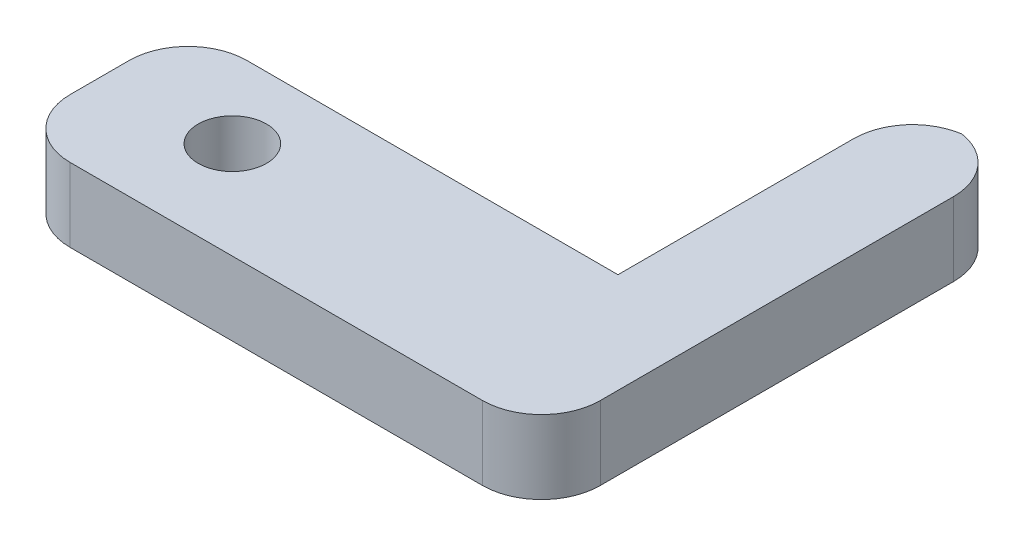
ISO-10303-21;
HEADER;
FILE_DESCRIPTION(('STEP AP214'),'2;1');
FILE_NAME('part.step','',(''),(''),'','','');
FILE_SCHEMA(('AUTOMOTIVE_DESIGN { 1 0 10303 214 1 1 1 1 }'));
ENDSEC;
DATA;
#1=APPLICATION_CONTEXT('core data for automotive mechanical design processes');
#2=APPLICATION_PROTOCOL_DEFINITION('international standard','automotive_design',2000,#1);
#3=PRODUCT_CONTEXT('',#1,'mechanical');
#4=PRODUCT('Part','Part','',(#3));
#5=PRODUCT_RELATED_PRODUCT_CATEGORY('part','',(#4));
#6=PRODUCT_DEFINITION_FORMATION('','',#4);
#7=PRODUCT_DEFINITION_CONTEXT('part definition',#1,'design');
#8=PRODUCT_DEFINITION('design','',#6,#7);
#9=PRODUCT_DEFINITION_SHAPE('','',#8);
#10=(LENGTH_UNIT() NAMED_UNIT(*) SI_UNIT(.MILLI.,.METRE.));
#11=(NAMED_UNIT(*) PLANE_ANGLE_UNIT() SI_UNIT($,.RADIAN.));
#12=(NAMED_UNIT(*) SI_UNIT($,.STERADIAN.) SOLID_ANGLE_UNIT());
#13=UNCERTAINTY_MEASURE_WITH_UNIT(LENGTH_MEASURE(1.E-05),#10,'distance_accuracy_value','');
#14=(GEOMETRIC_REPRESENTATION_CONTEXT(3) GLOBAL_UNCERTAINTY_ASSIGNED_CONTEXT((#13)) GLOBAL_UNIT_ASSIGNED_CONTEXT((#10,
#11,#12)) REPRESENTATION_CONTEXT('',''));
#15=CARTESIAN_POINT('',(0.,0.,0.));
#16=DIRECTION('',(0.,0.,1.));
#17=DIRECTION('',(1.,0.,0.));
#18=AXIS2_PLACEMENT_3D('',#15,#16,#17);
#19=CARTESIAN_POINT('',(0.,3.175,0.));
#20=DIRECTION('',(1.,0.,0.));
#21=DIRECTION('',(0.,0.,-1.));
#22=AXIS2_PLACEMENT_3D('',#19,#20,#21);
#23=PLANE('',#22);
#24=DIRECTION('',(0.,0.,1.));
#25=VECTOR('',#24,1.);
#26=CARTESIAN_POINT('',(0.,3.175,0.));
#27=LINE('',#26,#25);
#28=CARTESIAN_POINT('',(0.,3.175,-5.08));
#29=VERTEX_POINT('',#28);
#30=CARTESIAN_POINT('',(0.,3.175,-2.54));
#31=VERTEX_POINT('',#30);
#32=EDGE_CURVE('E143',#29,#31,#27,.T.);
#33=ORIENTED_EDGE('',*,*,#32,.F.);
#34=DIRECTION('',(0.,-1.,0.));
#35=VECTOR('',#34,1.);
#36=CARTESIAN_POINT('',(0.,3.175,-5.08));
#37=LINE('',#36,#35);
#38=CARTESIAN_POINT('',(0.,0.,-5.08));
#39=VERTEX_POINT('',#38);
#40=EDGE_CURVE('E146',#29,#39,#37,.T.);
#41=ORIENTED_EDGE('',*,*,#40,.T.);
#42=DIRECTION('',(0.,0.,1.));
#43=VECTOR('',#42,1.);
#44=CARTESIAN_POINT('',(0.,0.,0.));
#45=LINE('',#44,#43);
#46=CARTESIAN_POINT('',(0.,0.,-2.54));
#47=VERTEX_POINT('',#46);
#48=EDGE_CURVE('E132',#39,#47,#45,.T.);
#49=ORIENTED_EDGE('',*,*,#48,.T.);
#50=DIRECTION('',(0.,-1.,0.));
#51=VECTOR('',#50,1.);
#52=CARTESIAN_POINT('',(0.,3.175,-2.54));
#53=LINE('',#52,#51);
#54=EDGE_CURVE('E124',#47,#31,#53,.F.);
#55=ORIENTED_EDGE('',*,*,#54,.T.);
#56=EDGE_LOOP('',(#33,#41,#49,#55));
#57=FACE_BOUND('',#56,.T.);
#58=ADVANCED_FACE('F33',(#57),#23,.F.);
#59=CARTESIAN_POINT('',(0.,3.175,0.));
#60=DIRECTION('',(0.,0.,-1.));
#61=DIRECTION('',(-1.,0.,0.));
#62=AXIS2_PLACEMENT_3D('',#59,#60,#61);
#63=PLANE('',#62);
#64=DIRECTION('',(1.,0.,0.));
#65=VECTOR('',#64,1.);
#66=CARTESIAN_POINT('',(0.,3.175,0.));
#67=LINE('',#66,#65);
#68=CARTESIAN_POINT('',(2.54,3.175,0.));
#69=VERTEX_POINT('',#68);
#70=CARTESIAN_POINT('',(20.32,3.175,0.));
#71=VERTEX_POINT('',#70);
#72=EDGE_CURVE('E187',#69,#71,#67,.T.);
#73=ORIENTED_EDGE('',*,*,#72,.F.);
#74=DIRECTION('',(0.,-1.,0.));
#75=VECTOR('',#74,1.);
#76=CARTESIAN_POINT('',(2.54,3.175,0.));
#77=LINE('',#76,#75);
#78=CARTESIAN_POINT('',(2.54,0.,0.));
#79=VERTEX_POINT('',#78);
#80=EDGE_CURVE('E170',#69,#79,#77,.T.);
#81=ORIENTED_EDGE('',*,*,#80,.T.);
#82=DIRECTION('',(1.,0.,0.));
#83=VECTOR('',#82,1.);
#84=CARTESIAN_POINT('',(0.,0.,0.));
#85=LINE('',#84,#83);
#86=CARTESIAN_POINT('',(20.32,0.,0.));
#87=VERTEX_POINT('',#86);
#88=EDGE_CURVE('E135',#79,#87,#85,.T.);
#89=ORIENTED_EDGE('',*,*,#88,.T.);
#90=DIRECTION('',(0.,-1.,0.));
#91=VECTOR('',#90,1.);
#92=CARTESIAN_POINT('',(20.32,3.175,0.));
#93=LINE('',#92,#91);
#94=EDGE_CURVE('E168',#87,#71,#93,.F.);
#95=ORIENTED_EDGE('',*,*,#94,.T.);
#96=EDGE_LOOP('',(#73,#81,#89,#95));
#97=FACE_BOUND('',#96,.T.);
#98=ADVANCED_FACE('F214',(#97),#63,.F.);
#99=CARTESIAN_POINT('',(22.86,3.175,0.));
#100=DIRECTION('',(-1.,0.,0.));
#101=DIRECTION('',(0.,0.,1.));
#102=AXIS2_PLACEMENT_3D('',#99,#100,#101);
#103=PLANE('',#102);
#104=DIRECTION('',(0.,0.,-1.));
#105=VECTOR('',#104,1.);
#106=CARTESIAN_POINT('',(22.86,0.,0.));
#107=LINE('',#106,#105);
#108=CARTESIAN_POINT('',(22.86,0.,-2.54));
#109=VERTEX_POINT('',#108);
#110=CARTESIAN_POINT('',(22.86,0.,-17.78));
#111=VERTEX_POINT('',#110);
#112=EDGE_CURVE('E138',#109,#111,#107,.T.);
#113=ORIENTED_EDGE('',*,*,#112,.T.);
#114=DIRECTION('',(0.,-1.,0.));
#115=VECTOR('',#114,1.);
#116=CARTESIAN_POINT('',(22.86,3.175,-17.78));
#117=LINE('',#116,#115);
#118=CARTESIAN_POINT('',(22.86,3.175,-17.78));
#119=VERTEX_POINT('',#118);
#120=EDGE_CURVE('E42',#111,#119,#117,.F.);
#121=ORIENTED_EDGE('',*,*,#120,.T.);
#122=DIRECTION('',(0.,0.,-1.));
#123=VECTOR('',#122,1.);
#124=CARTESIAN_POINT('',(22.86,3.175,0.));
#125=LINE('',#124,#123);
#126=CARTESIAN_POINT('',(22.86,3.175,-2.54));
#127=VERTEX_POINT('',#126);
#128=EDGE_CURVE('E114',#127,#119,#125,.T.);
#129=ORIENTED_EDGE('',*,*,#128,.F.);
#130=DIRECTION('',(0.,-1.,0.));
#131=VECTOR('',#130,1.);
#132=CARTESIAN_POINT('',(22.86,3.175,-2.54));
#133=LINE('',#132,#131);
#134=EDGE_CURVE('E173',#127,#109,#133,.T.);
#135=ORIENTED_EDGE('',*,*,#134,.T.);
#136=EDGE_LOOP('',(#113,#121,#129,#135));
#137=FACE_BOUND('',#136,.T.);
#138=ADVANCED_FACE('F180',(#137),#103,.F.);
#139=CARTESIAN_POINT('',(18.542,3.175,-7.62));
#140=DIRECTION('',(1.,0.,0.));
#141=DIRECTION('',(0.,0.,-1.));
#142=AXIS2_PLACEMENT_3D('',#139,#140,#141);
#143=PLANE('',#142);
#144=DIRECTION('',(0.,0.,1.));
#145=VECTOR('',#144,1.);
#146=CARTESIAN_POINT('',(18.542,3.175,-7.62));
#147=LINE('',#146,#145);
#148=CARTESIAN_POINT('',(18.542,3.175,-17.78));
#149=VERTEX_POINT('',#148);
#150=CARTESIAN_POINT('',(18.542,3.175,-7.62));
#151=VERTEX_POINT('',#150);
#152=EDGE_CURVE('E106',#149,#151,#147,.T.);
#153=ORIENTED_EDGE('',*,*,#152,.F.);
#154=DIRECTION('',(0.,-1.,0.));
#155=VECTOR('',#154,1.);
#156=CARTESIAN_POINT('',(18.542,3.175,-17.78));
#157=LINE('',#156,#155);
#158=CARTESIAN_POINT('',(18.542,0.,-17.78));
#159=VERTEX_POINT('',#158);
#160=EDGE_CURVE('E11',#149,#159,#157,.T.);
#161=ORIENTED_EDGE('',*,*,#160,.T.);
#162=DIRECTION('',(0.,0.,1.));
#163=VECTOR('',#162,1.);
#164=CARTESIAN_POINT('',(18.542,0.,-7.62));
#165=LINE('',#164,#163);
#166=CARTESIAN_POINT('',(18.542,0.,-7.62));
#167=VERTEX_POINT('',#166);
#168=EDGE_CURVE('E120',#159,#167,#165,.T.);
#169=ORIENTED_EDGE('',*,*,#168,.T.);
#170=DIRECTION('',(0.,-1.,0.));
#171=VECTOR('',#170,1.);
#172=CARTESIAN_POINT('',(18.542,3.175,-7.62));
#173=LINE('',#172,#171);
#174=EDGE_CURVE('E117',#151,#167,#173,.T.);
#175=ORIENTED_EDGE('',*,*,#174,.F.);
#176=EDGE_LOOP('',(#153,#161,#169,#175));
#177=FACE_BOUND('',#176,.T.);
#178=ADVANCED_FACE('F118',(#177),#143,.F.);
#179=CARTESIAN_POINT('',(0.,3.175,-7.62));
#180=DIRECTION('',(0.,0.,1.));
#181=DIRECTION('',(1.,0.,0.));
#182=AXIS2_PLACEMENT_3D('',#179,#180,#181);
#183=PLANE('',#182);
#184=DIRECTION('',(-1.,0.,0.));
#185=VECTOR('',#184,1.);
#186=CARTESIAN_POINT('',(0.,0.,-7.62));
#187=LINE('',#186,#185);
#188=CARTESIAN_POINT('',(2.54,0.,-7.62));
#189=VERTEX_POINT('',#188);
#190=EDGE_CURVE('E142',#167,#189,#187,.T.);
#191=ORIENTED_EDGE('',*,*,#190,.T.);
#192=DIRECTION('',(0.,-1.,0.));
#193=VECTOR('',#192,1.);
#194=CARTESIAN_POINT('',(2.54,3.175,-7.62));
#195=LINE('',#194,#193);
#196=CARTESIAN_POINT('',(2.54,3.175,-7.62));
#197=VERTEX_POINT('',#196);
#198=EDGE_CURVE('E128',#189,#197,#195,.F.);
#199=ORIENTED_EDGE('',*,*,#198,.T.);
#200=DIRECTION('',(-1.,0.,0.));
#201=VECTOR('',#200,1.);
#202=CARTESIAN_POINT('',(0.,3.175,-7.62));
#203=LINE('',#202,#201);
#204=EDGE_CURVE('E110',#151,#197,#203,.T.);
#205=ORIENTED_EDGE('',*,*,#204,.F.);
#206=ORIENTED_EDGE('',*,*,#174,.T.);
#207=EDGE_LOOP('',(#191,#199,#205,#206));
#208=FACE_BOUND('',#207,.T.);
#209=ADVANCED_FACE('F126',(#208),#183,.F.);
#210=CARTESIAN_POINT('',(0.,3.175,0.));
#211=DIRECTION('',(0.,-1.,0.));
#212=DIRECTION('',(0.,0.,-1.));
#213=AXIS2_PLACEMENT_3D('',#210,#211,#212);
#214=PLANE('',#213);
#215=CARTESIAN_POINT('',(5.334,3.175,-4.19737379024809));
#216=DIRECTION('',(0.,1.,0.));
#217=DIRECTION('',(0.,0.,1.));
#218=AXIS2_PLACEMENT_3D('',#215,#216,#217);
#219=CIRCLE('',#218,1.47319999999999);
#220=CARTESIAN_POINT('',(5.334,3.175,-2.72417379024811));
#221=VERTEX_POINT('',#220);
#222=EDGE_CURVE('E195',#221,#221,#219,.T.);
#223=ORIENTED_EDGE('',*,*,#222,.F.);
#224=EDGE_LOOP('',(#223));
#225=FACE_BOUND('',#224,.T.);
#226=ORIENTED_EDGE('',*,*,#204,.T.);
#227=CARTESIAN_POINT('',(2.54,3.175,-5.08));
#228=DIRECTION('',(0.,-1.,0.));
#229=DIRECTION('',(0.,0.,-1.));
#230=AXIS2_PLACEMENT_3D('',#227,#228,#229);
#231=CIRCLE('',#230,2.54);
#232=EDGE_CURVE('E166',#197,#29,#231,.F.);
#233=ORIENTED_EDGE('',*,*,#232,.T.);
#234=ORIENTED_EDGE('',*,*,#32,.T.);
#235=CARTESIAN_POINT('',(2.54,3.175,-2.54));
#236=DIRECTION('',(0.,-1.,0.));
#237=DIRECTION('',(0.,0.,-1.));
#238=AXIS2_PLACEMENT_3D('',#235,#236,#237);
#239=CIRCLE('',#238,2.54);
#240=EDGE_CURVE('E164',#31,#69,#239,.F.);
#241=ORIENTED_EDGE('',*,*,#240,.T.);
#242=ORIENTED_EDGE('',*,*,#72,.T.);
#243=CARTESIAN_POINT('',(20.32,3.175,-2.54));
#244=DIRECTION('',(0.,-1.,0.));
#245=DIRECTION('',(0.,0.,-1.));
#246=AXIS2_PLACEMENT_3D('',#243,#244,#245);
#247=CIRCLE('',#246,2.54);
#248=EDGE_CURVE('E160',#71,#127,#247,.F.);
#249=ORIENTED_EDGE('',*,*,#248,.T.);
#250=ORIENTED_EDGE('',*,*,#128,.T.);
#251=CARTESIAN_POINT('',(20.32,3.175,-17.78));
#252=DIRECTION('',(0.,-1.,0.));
#253=DIRECTION('',(0.,0.,-1.));
#254=AXIS2_PLACEMENT_3D('',#251,#252,#253);
#255=CIRCLE('',#254,2.54);
#256=CARTESIAN_POINT('',(20.701,3.175,-20.2912624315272));
#257=VERTEX_POINT('',#256);
#258=EDGE_CURVE('E49',#119,#257,#255,.F.);
#259=ORIENTED_EDGE('',*,*,#258,.T.);
#260=CARTESIAN_POINT('',(21.082,3.175,-17.78));
#261=DIRECTION('',(0.,-1.,0.));
#262=DIRECTION('',(0.,0.,-1.));
#263=AXIS2_PLACEMENT_3D('',#260,#261,#262);
#264=CIRCLE('',#263,2.54);
#265=EDGE_CURVE('E53',#257,#149,#264,.F.);
#266=ORIENTED_EDGE('',*,*,#265,.T.);
#267=ORIENTED_EDGE('',*,*,#152,.T.);
#268=EDGE_LOOP('',(#226,#233,#234,#241,#242,#249,#250,#259,#266,#267));
#269=FACE_BOUND('',#268,.T.);
#270=ADVANCED_FACE('F108',(#225,#269),#214,.F.);
#271=CARTESIAN_POINT('',(0.,0.,0.));
#272=DIRECTION('',(0.,-1.,0.));
#273=DIRECTION('',(0.,0.,-1.));
#274=AXIS2_PLACEMENT_3D('',#271,#272,#273);
#275=PLANE('',#274);
#276=CARTESIAN_POINT('',(5.334,0.,-4.19737379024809));
#277=DIRECTION('',(0.,1.,0.));
#278=DIRECTION('',(0.,0.,1.));
#279=AXIS2_PLACEMENT_3D('',#276,#277,#278);
#280=CIRCLE('',#279,1.4732);
#281=CARTESIAN_POINT('',(5.334,0.,-2.72417379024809));
#282=VERTEX_POINT('',#281);
#283=EDGE_CURVE('E192',#282,#282,#280,.T.);
#284=ORIENTED_EDGE('',*,*,#283,.T.);
#285=EDGE_LOOP('',(#284));
#286=FACE_BOUND('',#285,.T.);
#287=ORIENTED_EDGE('',*,*,#48,.F.);
#288=CARTESIAN_POINT('',(2.54,0.,-5.08));
#289=DIRECTION('',(0.,-1.,0.));
#290=DIRECTION('',(0.,0.,-1.));
#291=AXIS2_PLACEMENT_3D('',#288,#289,#290);
#292=CIRCLE('',#291,2.54);
#293=EDGE_CURVE('E157',#39,#189,#292,.T.);
#294=ORIENTED_EDGE('',*,*,#293,.T.);
#295=ORIENTED_EDGE('',*,*,#190,.F.);
#296=ORIENTED_EDGE('',*,*,#168,.F.);
#297=CARTESIAN_POINT('',(21.082,0.,-17.78));
#298=DIRECTION('',(0.,-1.,0.));
#299=DIRECTION('',(0.,0.,-1.));
#300=AXIS2_PLACEMENT_3D('',#297,#298,#299);
#301=CIRCLE('',#300,2.54);
#302=CARTESIAN_POINT('',(20.701,0.,-20.2912624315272));
#303=VERTEX_POINT('',#302);
#304=EDGE_CURVE('E151',#159,#303,#301,.T.);
#305=ORIENTED_EDGE('',*,*,#304,.T.);
#306=CARTESIAN_POINT('',(20.32,0.,-17.78));
#307=DIRECTION('',(0.,-1.,0.));
#308=DIRECTION('',(0.,0.,-1.));
#309=AXIS2_PLACEMENT_3D('',#306,#307,#308);
#310=CIRCLE('',#309,2.54);
#311=EDGE_CURVE('E153',#303,#111,#310,.T.);
#312=ORIENTED_EDGE('',*,*,#311,.T.);
#313=ORIENTED_EDGE('',*,*,#112,.F.);
#314=CARTESIAN_POINT('',(20.32,0.,-2.54));
#315=DIRECTION('',(0.,-1.,0.));
#316=DIRECTION('',(0.,0.,-1.));
#317=AXIS2_PLACEMENT_3D('',#314,#315,#316);
#318=CIRCLE('',#317,2.54);
#319=EDGE_CURVE('E149',#109,#87,#318,.T.);
#320=ORIENTED_EDGE('',*,*,#319,.T.);
#321=ORIENTED_EDGE('',*,*,#88,.F.);
#322=CARTESIAN_POINT('',(2.54,0.,-2.54));
#323=DIRECTION('',(0.,-1.,0.));
#324=DIRECTION('',(0.,0.,-1.));
#325=AXIS2_PLACEMENT_3D('',#322,#323,#324);
#326=CIRCLE('',#325,2.54);
#327=EDGE_CURVE('E155',#79,#47,#326,.T.);
#328=ORIENTED_EDGE('',*,*,#327,.T.);
#329=EDGE_LOOP('',(#287,#294,#295,#296,#305,#312,#313,#320,#321,#328));
#330=FACE_BOUND('',#329,.T.);
#331=ADVANCED_FACE('F202',(#286,#330),#275,.T.);
#332=CARTESIAN_POINT('',(2.54,3.175,-5.08));
#333=DIRECTION('',(0.,-1.,0.));
#334=DIRECTION('',(0.,0.,-1.));
#335=AXIS2_PLACEMENT_3D('',#332,#333,#334);
#336=CYLINDRICAL_SURFACE('',#335,2.54);
#337=ORIENTED_EDGE('',*,*,#232,.F.);
#338=ORIENTED_EDGE('',*,*,#198,.F.);
#339=ORIENTED_EDGE('',*,*,#293,.F.);
#340=ORIENTED_EDGE('',*,*,#40,.F.);
#341=EDGE_LOOP('',(#337,#338,#339,#340));
#342=FACE_BOUND('',#341,.T.);
#343=ADVANCED_FACE('F208',(#342),#336,.T.);
#344=CARTESIAN_POINT('',(2.54,3.175,-2.54));
#345=DIRECTION('',(0.,-1.,0.));
#346=DIRECTION('',(0.,0.,-1.));
#347=AXIS2_PLACEMENT_3D('',#344,#345,#346);
#348=CYLINDRICAL_SURFACE('',#347,2.54);
#349=ORIENTED_EDGE('',*,*,#240,.F.);
#350=ORIENTED_EDGE('',*,*,#54,.F.);
#351=ORIENTED_EDGE('',*,*,#327,.F.);
#352=ORIENTED_EDGE('',*,*,#80,.F.);
#353=EDGE_LOOP('',(#349,#350,#351,#352));
#354=FACE_BOUND('',#353,.T.);
#355=ADVANCED_FACE('F227',(#354),#348,.T.);
#356=CARTESIAN_POINT('',(21.082,3.175,-17.78));
#357=DIRECTION('',(0.,-1.,0.));
#358=DIRECTION('',(0.,0.,-1.));
#359=AXIS2_PLACEMENT_3D('',#356,#357,#358);
#360=CYLINDRICAL_SURFACE('',#359,2.54);
#361=ORIENTED_EDGE('',*,*,#160,.F.);
#362=ORIENTED_EDGE('',*,*,#265,.F.);
#363=DIRECTION('',(0.,-1.,0.));
#364=VECTOR('',#363,1.);
#365=CARTESIAN_POINT('',(20.701,1.5875,-20.2912624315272));
#366=LINE('',#365,#364);
#367=EDGE_CURVE('E37',#303,#257,#366,.F.);
#368=ORIENTED_EDGE('',*,*,#367,.F.);
#369=ORIENTED_EDGE('',*,*,#304,.F.);
#370=EDGE_LOOP('',(#361,#362,#368,#369));
#371=FACE_BOUND('',#370,.T.);
#372=ADVANCED_FACE('F231',(#371),#360,.T.);
#373=CARTESIAN_POINT('',(20.32,3.175,-17.78));
#374=DIRECTION('',(0.,-1.,0.));
#375=DIRECTION('',(0.,0.,-1.));
#376=AXIS2_PLACEMENT_3D('',#373,#374,#375);
#377=CYLINDRICAL_SURFACE('',#376,2.54);
#378=ORIENTED_EDGE('',*,*,#258,.F.);
#379=ORIENTED_EDGE('',*,*,#120,.F.);
#380=ORIENTED_EDGE('',*,*,#311,.F.);
#381=ORIENTED_EDGE('',*,*,#367,.T.);
#382=EDGE_LOOP('',(#378,#379,#380,#381));
#383=FACE_BOUND('',#382,.T.);
#384=ADVANCED_FACE('F233',(#383),#377,.T.);
#385=CARTESIAN_POINT('',(20.32,3.175,-2.54));
#386=DIRECTION('',(0.,-1.,0.));
#387=DIRECTION('',(0.,0.,-1.));
#388=AXIS2_PLACEMENT_3D('',#385,#386,#387);
#389=CYLINDRICAL_SURFACE('',#388,2.54);
#390=ORIENTED_EDGE('',*,*,#248,.F.);
#391=ORIENTED_EDGE('',*,*,#94,.F.);
#392=ORIENTED_EDGE('',*,*,#319,.F.);
#393=ORIENTED_EDGE('',*,*,#134,.F.);
#394=EDGE_LOOP('',(#390,#391,#392,#393));
#395=FACE_BOUND('',#394,.T.);
#396=ADVANCED_FACE('F35',(#395),#389,.T.);
#397=CARTESIAN_POINT('',(5.334,3.175,-4.19737379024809));
#398=DIRECTION('',(0.,1.,0.));
#399=DIRECTION('',(0.,0.,1.));
#400=AXIS2_PLACEMENT_3D('',#397,#398,#399);
#401=CYLINDRICAL_SURFACE('',#400,1.47319999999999);
#402=ORIENTED_EDGE('',*,*,#283,.F.);
#403=EDGE_LOOP('',(#402));
#404=FACE_BOUND('',#403,.T.);
#405=ORIENTED_EDGE('',*,*,#222,.T.);
#406=EDGE_LOOP('',(#405));
#407=FACE_BOUND('',#406,.T.);
#408=ADVANCED_FACE('F199',(#404,#407),#401,.F.);
#409=CLOSED_SHELL('',(#58,#98,#138,#178,#209,#270,#331,#343,#355,#372,#384,#396,#408));
#410=MANIFOLD_SOLID_BREP('B2',#409);
#411=ADVANCED_BREP_SHAPE_REPRESENTATION('',(#18,#410),#14);
#412=SHAPE_DEFINITION_REPRESENTATION(#9,#411);
ENDSEC;
END-ISO-10303-21;
